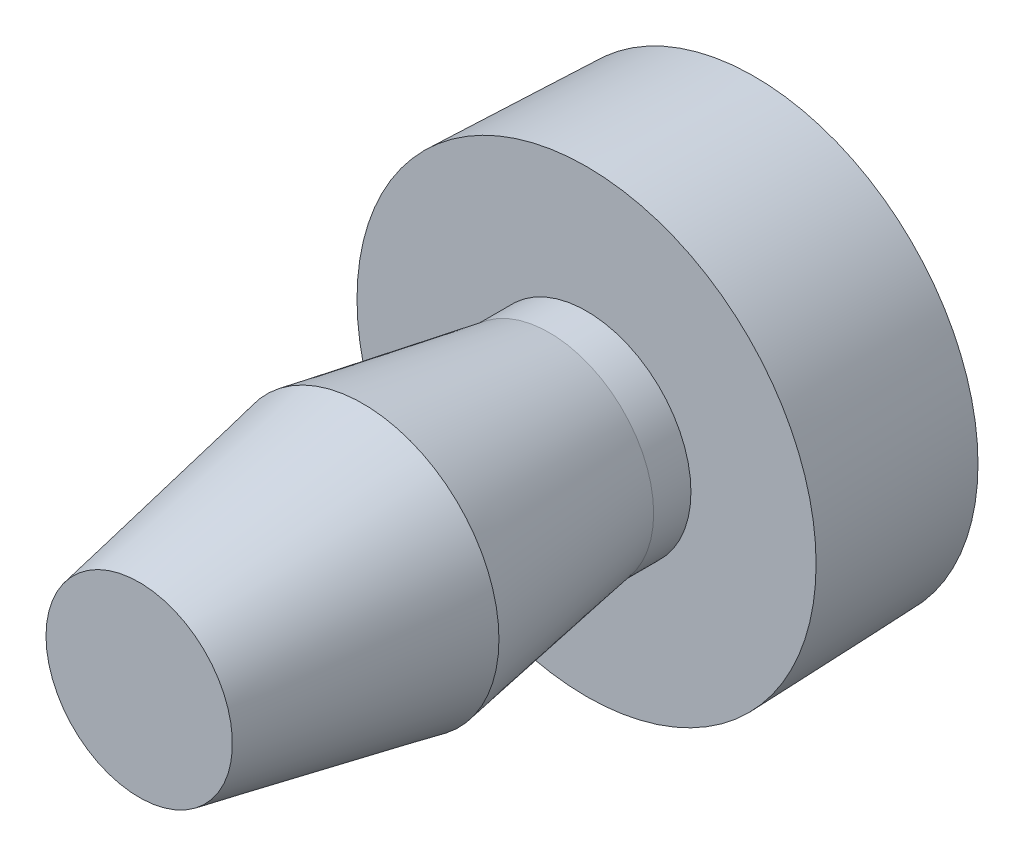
from build123d import *

# Parameters (mm, degrees)
ESQUISSE1_R         = 6
BASEEXTRUSION_DEPTH = 4.5
BASEEXTRUSION_DRAFT = -1.999999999


with BuildPart() as part:
    # Esquisse1 → BaseExtrusion (with draft: the straight prism first)
    with BuildSketch(Plane.XY):
        Circle(ESQUISSE1_R)
    extrude(amount=BASEEXTRUSION_DEPTH)
    # BaseExtrusion: the draft: its side faces are tilted about the plane it starts from
    baseextrusion_sides = [part.faces().sort_by_distance(p)[0] for p in [
        (-6, 0, 2.25),
    ]]
    draft(baseextrusion_sides, Plane.XY, BASEEXTRUSION_DRAFT)

    # Esquisse3 → Bossage-Rotation1 (revolve)
    with BuildSketch(Plane(origin=(0, 0, 0), x_dir=(0, 0, -1), z_dir=(1, 0, 0)), mode=Mode.PRIVATE) as bossage_rotation1_sk:
        Polygon((-4.5, 2.8), (-5.5, 2.8), (-10.5, 3.65), (-16.5, 2.5), (-16.5, 0), (-4.5, 0), align=None)
    revolve(bossage_rotation1_sk.sketch.rotate(Axis((0, 0, 1.964110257), (0, 0, 1)), 90), axis=Axis((0, 0, 1.964110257), (0, 0, 1)))


solid = part.part
